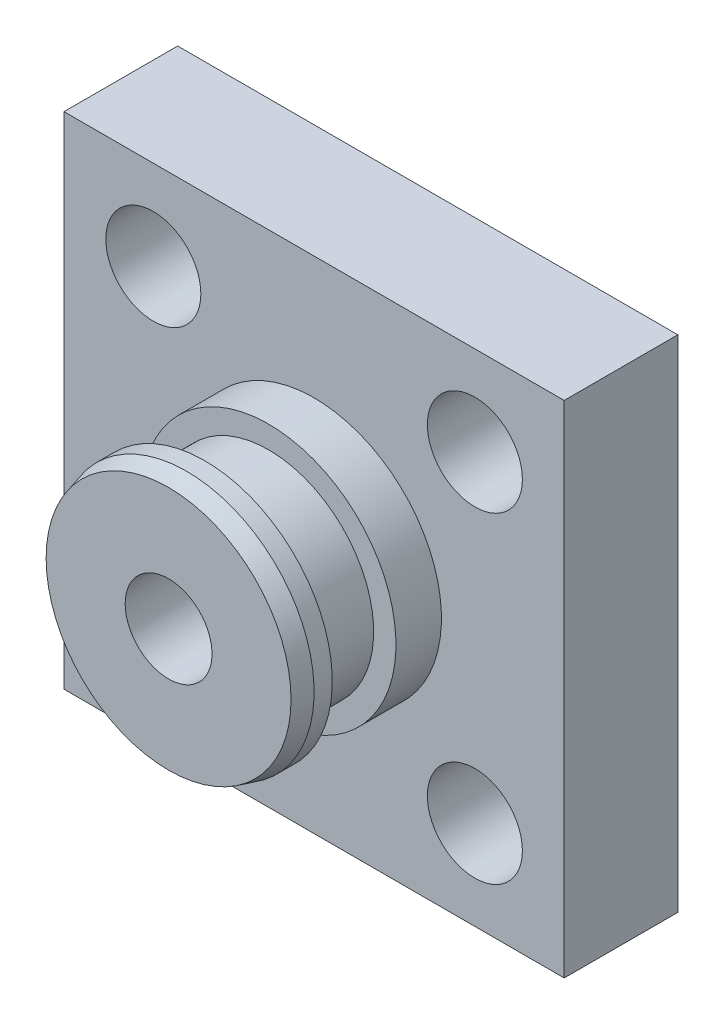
from build123d import *

# Parameters (mm, degrees)
SKETCH1_W          = 27.94
SKETCH1_H          = 27.94
BASE_DEPTH         = 6.35
SKETCH2_R          = 7.112
PLUG_DIA1_DEPTH    = 2.54
SKETCH3_R          = 5.8674
GROOVE_DIA_DEPTH   = 3.556
SKETCH4_R          = 7.112
PLUG_DIA2_DEPTH    = 2.032
SKETCH12_R         = 2.6543
BOLT_CIRCLE_DEPTH  = 22.363196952
CHAMFER1_SIZE      = 1.016
CHAMFER1_SIZE2     = 0.27223638
SKETCH15_R         = 2.4257
CENTER_BORE_DEPTH  = 50.8
SKETCH16_R         = 3.2004
CUT_EXTRUDE2_DEPTH = 5.08


with BuildPart() as part:
    # Sketch1 → base (new body)
    with BuildSketch(Plane.XY):
        Rectangle(SKETCH1_W, SKETCH1_H)
    extrude(amount=BASE_DEPTH)

    # Sketch2 → plug_dia1 (add)
    with BuildSketch(Plane.XY.offset(6.35)):
        Circle(SKETCH2_R)
    extrude(amount=PLUG_DIA1_DEPTH)

    # Sketch3 → groove_dia (add)
    with BuildSketch(Plane.XY.offset(8.89)):
        Circle(SKETCH3_R)
    extrude(amount=GROOVE_DIA_DEPTH)

    # Sketch4 → plug_dia2 (add)
    with BuildSketch(Plane.XY.offset(12.446)):
        Circle(SKETCH4_R)
    extrude(amount=PLUG_DIA2_DEPTH)

    # Sketch12 → bolt_circle (cut, through all)
    with BuildSketch(Plane.XY.offset(6.35)):
        with Locations((8.980256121, 8.980256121)):
            Circle(SKETCH12_R)
        with Locations((8.980256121, -8.980256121)):
            Circle(SKETCH12_R)
        with Locations((-8.980256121, -8.980256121)):
            Circle(SKETCH12_R)
        with Locations((-8.980256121, 8.980256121)):
            Circle(SKETCH12_R)
    extrude(amount=-BOLT_CIRCLE_DEPTH, mode=Mode.SUBTRACT)

    # Chamfer1
    chamfer1_edges = [part.edges().sort_by_distance(p)[0] for p in [
        (-7.112, 0, 14.478),
    ]]
    chamfer1_side = [part.faces().sort_by_distance(p)[0] for p in [
        (-7.112, 0, 13.462),
    ]]
    chamfer(chamfer1_edges, length=CHAMFER1_SIZE, length2=CHAMFER1_SIZE2, reference=chamfer1_side[0])

    # Sketch15 → center_bore (cut)
    with BuildSketch(Plane(origin=(0, 0, 0), x_dir=(-1, 0, 0), z_dir=(0, 0, -1))):
        Circle(SKETCH15_R)
    extrude(amount=-CENTER_BORE_DEPTH, mode=Mode.SUBTRACT)

    # Sketch16 → Cut-Extrude2 (cut)
    with BuildSketch(Plane(origin=(0, 0, 0), x_dir=(-1, 0, 0), z_dir=(0, 0, -1))):
        Circle(SKETCH16_R)
    extrude(amount=-CUT_EXTRUDE2_DEPTH, mode=Mode.SUBTRACT)


solid = part.part
